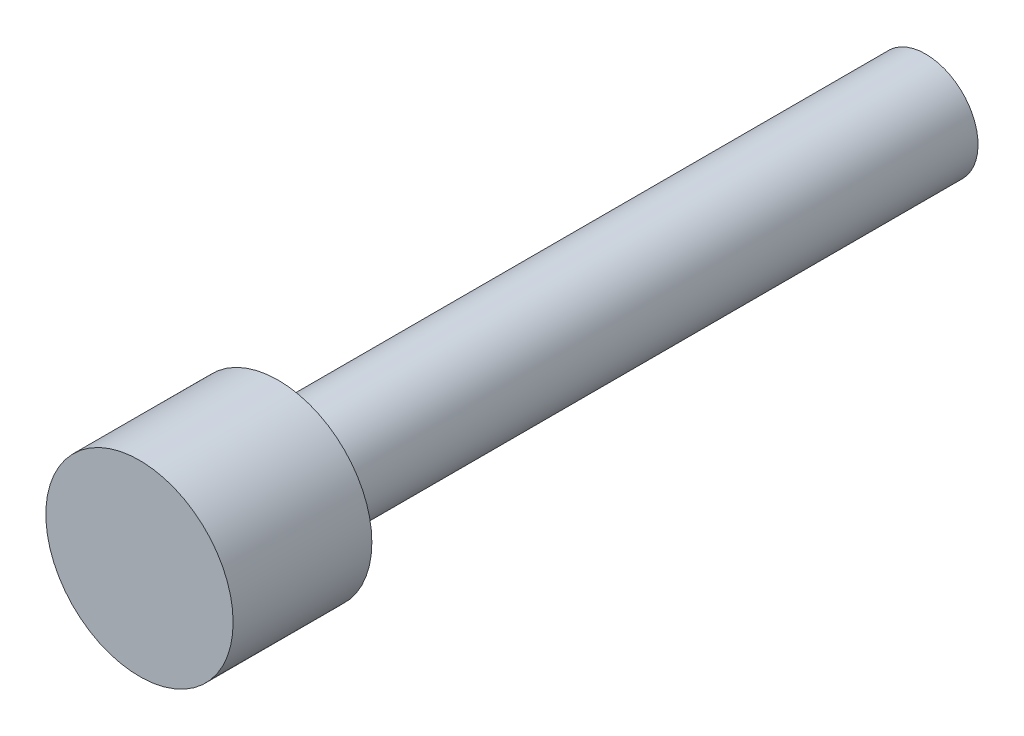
ISO-10303-21;
HEADER;
FILE_DESCRIPTION(('STEP AP214'),'2;1');
FILE_NAME('part.step','',(''),(''),'','','');
FILE_SCHEMA(('AUTOMOTIVE_DESIGN { 1 0 10303 214 1 1 1 1 }'));
ENDSEC;
DATA;
#1=APPLICATION_CONTEXT('core data for automotive mechanical design processes');
#2=APPLICATION_PROTOCOL_DEFINITION('international standard','automotive_design',2000,#1);
#3=PRODUCT_CONTEXT('',#1,'mechanical');
#4=PRODUCT('Part','Part','',(#3));
#5=PRODUCT_RELATED_PRODUCT_CATEGORY('part','',(#4));
#6=PRODUCT_DEFINITION_FORMATION('','',#4);
#7=PRODUCT_DEFINITION_CONTEXT('part definition',#1,'design');
#8=PRODUCT_DEFINITION('design','',#6,#7);
#9=PRODUCT_DEFINITION_SHAPE('','',#8);
#10=(LENGTH_UNIT() NAMED_UNIT(*) SI_UNIT(.MILLI.,.METRE.));
#11=(NAMED_UNIT(*) PLANE_ANGLE_UNIT() SI_UNIT($,.RADIAN.));
#12=(NAMED_UNIT(*) SI_UNIT($,.STERADIAN.) SOLID_ANGLE_UNIT());
#13=UNCERTAINTY_MEASURE_WITH_UNIT(LENGTH_MEASURE(1.E-05),#10,'distance_accuracy_value','');
#14=(GEOMETRIC_REPRESENTATION_CONTEXT(3) GLOBAL_UNCERTAINTY_ASSIGNED_CONTEXT((#13)) GLOBAL_UNIT_ASSIGNED_CONTEXT((#10,
#11,#12)) REPRESENTATION_CONTEXT('',''));
#15=CARTESIAN_POINT('',(0.,0.,0.));
#16=DIRECTION('',(0.,0.,1.));
#17=DIRECTION('',(1.,0.,0.));
#18=AXIS2_PLACEMENT_3D('',#15,#16,#17);
#19=CARTESIAN_POINT('',(0.,0.,-9.525));
#20=DIRECTION('',(0.,0.,-1.));
#21=DIRECTION('',(1.,0.,0.));
#22=AXIS2_PLACEMENT_3D('',#19,#20,#21);
#23=PLANE('',#22);
#24=CARTESIAN_POINT('',(0.,0.,-9.525));
#25=DIRECTION('',(0.,0.,-1.));
#26=DIRECTION('',(0.,1.,0.));
#27=AXIS2_PLACEMENT_3D('',#24,#25,#26);
#28=CIRCLE('',#27,3.59537);
#29=CARTESIAN_POINT('',(0.,3.59537,-9.525));
#30=VERTEX_POINT('',#29);
#31=EDGE_CURVE('E10',#30,#30,#28,.T.);
#32=ORIENTED_EDGE('',*,*,#31,.F.);
#33=EDGE_LOOP('',(#32));
#34=FACE_BOUND('',#33,.T.);
#35=CARTESIAN_POINT('',(0.,0.,-9.525));
#36=DIRECTION('',(0.,0.,-1.));
#37=DIRECTION('',(0.,1.,0.));
#38=AXIS2_PLACEMENT_3D('',#35,#36,#37);
#39=CIRCLE('',#38,6.42937500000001);
#40=CARTESIAN_POINT('',(0.,6.42937500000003,-9.525));
#41=VERTEX_POINT('',#40);
#42=EDGE_CURVE('E34',#41,#41,#39,.F.);
#43=ORIENTED_EDGE('',*,*,#42,.F.);
#44=EDGE_LOOP('',(#43));
#45=FACE_BOUND('',#44,.T.);
#46=ADVANCED_FACE('F31',(#34,#45),#23,.T.);
#47=CARTESIAN_POINT('',(0.,0.,0.));
#48=DIRECTION('',(0.,0.,1.));
#49=DIRECTION('',(1.,0.,0.));
#50=AXIS2_PLACEMENT_3D('',#47,#48,#49);
#51=PLANE('',#50);
#52=CARTESIAN_POINT('',(0.,0.,0.));
#53=DIRECTION('',(0.,0.,1.));
#54=DIRECTION('',(1.,0.,0.));
#55=AXIS2_PLACEMENT_3D('',#52,#53,#54);
#56=CIRCLE('',#55,6.42937500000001);
#57=CARTESIAN_POINT('',(6.42937500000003,0.,0.));
#58=VERTEX_POINT('',#57);
#59=EDGE_CURVE('E42',#58,#58,#56,.T.);
#60=ORIENTED_EDGE('',*,*,#59,.T.);
#61=EDGE_LOOP('',(#60));
#62=FACE_BOUND('',#61,.T.);
#63=ADVANCED_FACE('F49',(#62),#51,.T.);
#64=CARTESIAN_POINT('',(0.,0.,-27.7100186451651));
#65=DIRECTION('',(0.,0.,1.));
#66=DIRECTION('',(1.,0.,0.));
#67=AXIS2_PLACEMENT_3D('',#64,#65,#66);
#68=CYLINDRICAL_SURFACE('',#67,6.42937500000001);
#69=ORIENTED_EDGE('',*,*,#59,.F.);
#70=EDGE_LOOP('',(#69));
#71=FACE_BOUND('',#70,.T.);
#72=ORIENTED_EDGE('',*,*,#42,.T.);
#73=EDGE_LOOP('',(#72));
#74=FACE_BOUND('',#73,.T.);
#75=ADVANCED_FACE('F51',(#71,#74),#68,.T.);
#76=CARTESIAN_POINT('',(0.,0.,-64.1442420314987));
#77=DIRECTION('',(0.,0.,1.));
#78=DIRECTION('',(0.,-1.,0.));
#79=AXIS2_PLACEMENT_3D('',#76,#77,#78);
#80=CYLINDRICAL_SURFACE('',#79,3.59537);
#81=ORIENTED_EDGE('',*,*,#31,.T.);
#82=EDGE_LOOP('',(#81));
#83=FACE_BOUND('',#82,.T.);
#84=CARTESIAN_POINT('',(0.,0.,-53.975));
#85=DIRECTION('',(0.,0.,-1.));
#86=DIRECTION('',(0.,1.,0.));
#87=AXIS2_PLACEMENT_3D('',#84,#85,#86);
#88=CIRCLE('',#87,3.59537);
#89=CARTESIAN_POINT('',(0.,3.59536999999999,-53.975));
#90=VERTEX_POINT('',#89);
#91=EDGE_CURVE('E44',#90,#90,#88,.T.);
#92=ORIENTED_EDGE('',*,*,#91,.F.);
#93=EDGE_LOOP('',(#92));
#94=FACE_BOUND('',#93,.T.);
#95=ADVANCED_FACE('F54',(#83,#94),#80,.T.);
#96=CARTESIAN_POINT('',(0.,0.,-53.975));
#97=DIRECTION('',(0.,0.,-1.));
#98=DIRECTION('',(-1.,0.,0.));
#99=AXIS2_PLACEMENT_3D('',#96,#97,#98);
#100=PLANE('',#99);
#101=ORIENTED_EDGE('',*,*,#91,.T.);
#102=EDGE_LOOP('',(#101));
#103=FACE_BOUND('',#102,.T.);
#104=ADVANCED_FACE('F66',(#103),#100,.T.);
#105=CLOSED_SHELL('',(#46,#63,#75,#95,#104));
#106=MANIFOLD_SOLID_BREP('B2',#105);
#107=ADVANCED_BREP_SHAPE_REPRESENTATION('',(#18,#106),#14);
#108=SHAPE_DEFINITION_REPRESENTATION(#9,#107);
ENDSEC;
END-ISO-10303-21;
